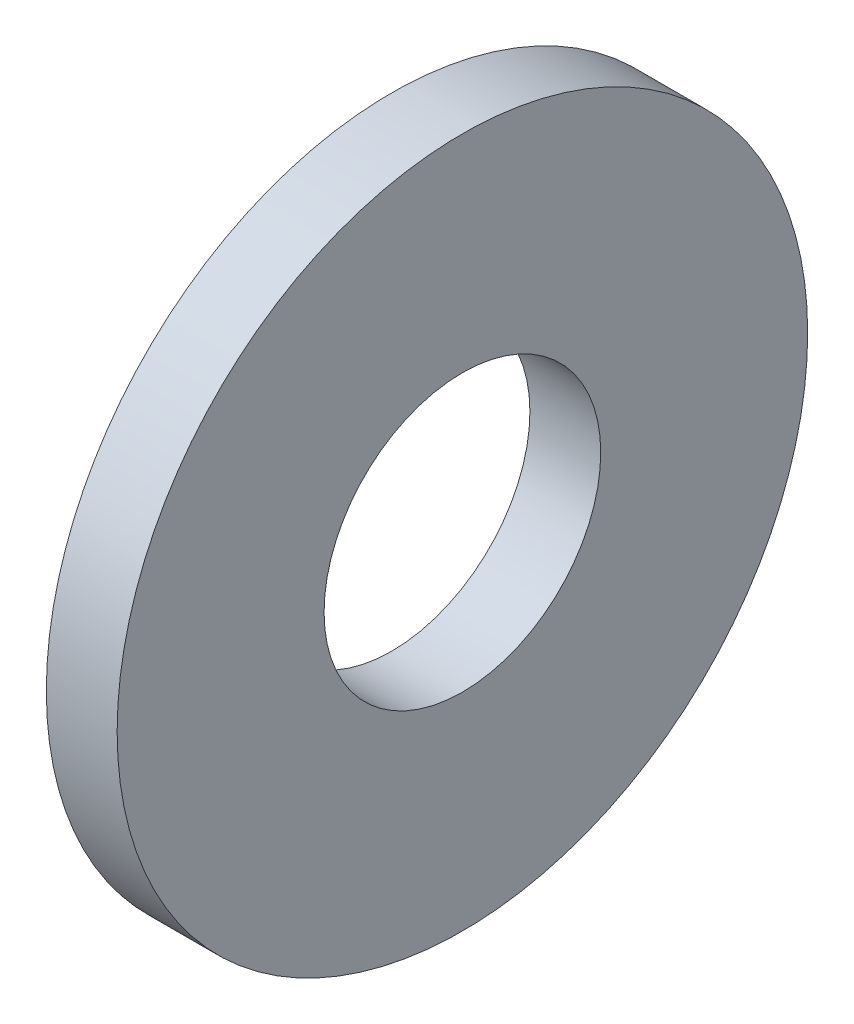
from build123d import *

# Parameters (mm, degrees)
SKETCH1_W = 0.8128
SKETCH1_H = 2.3749


with BuildPart() as part:
    # Sketch1 → Base-Revolve (revolve)
    with BuildSketch(Plane.XY, mode=Mode.PRIVATE) as base_revolve_sk:
        with Locations((-0.4064, 2.77495)):
            Rectangle(SKETCH1_W, SKETCH1_H)
    revolve(base_revolve_sk.sketch.rotate(Axis((-34.925, 0, 0), (1, 0, 0)), 90), axis=Axis((-34.925, 0, 0), (1, 0, 0)))


solid = part.part
